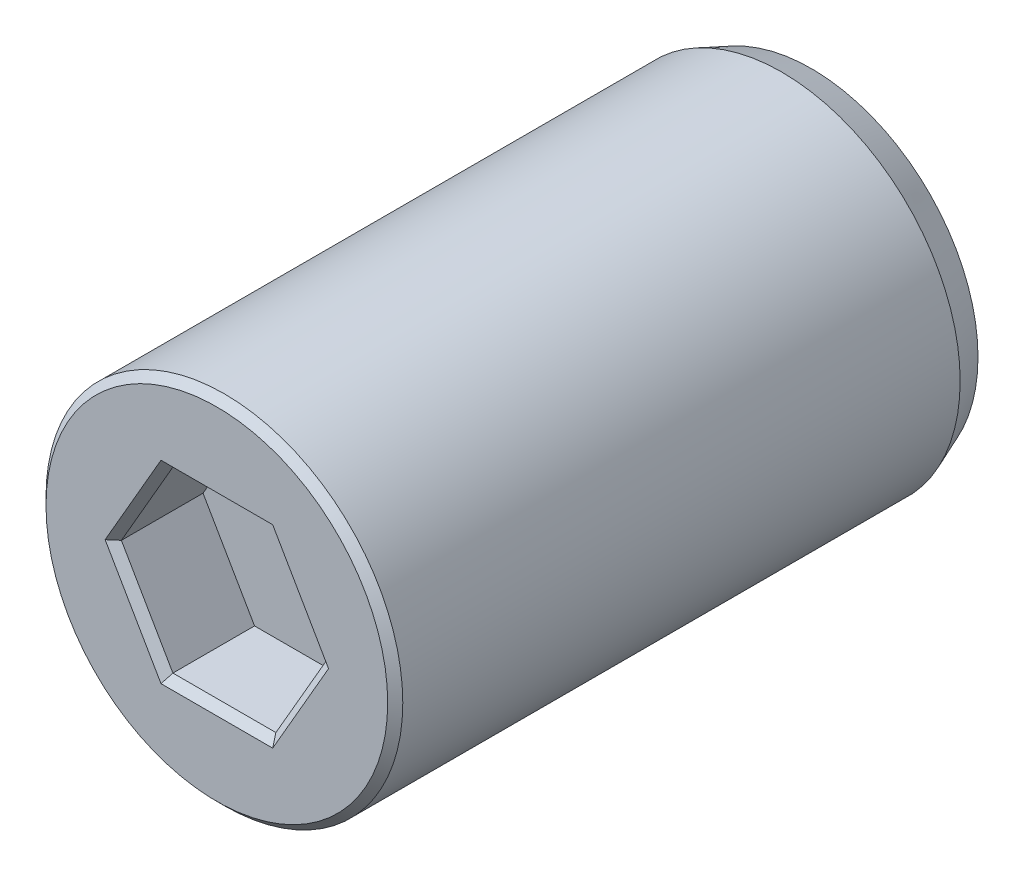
ISO-10303-21;
HEADER;
FILE_DESCRIPTION(('STEP AP214'),'2;1');
FILE_NAME('part.step','',(''),(''),'','','');
FILE_SCHEMA(('AUTOMOTIVE_DESIGN { 1 0 10303 214 1 1 1 1 }'));
ENDSEC;
DATA;
#1=APPLICATION_CONTEXT('core data for automotive mechanical design processes');
#2=APPLICATION_PROTOCOL_DEFINITION('international standard','automotive_design',2000,#1);
#3=PRODUCT_CONTEXT('',#1,'mechanical');
#4=PRODUCT('Part','Part','',(#3));
#5=PRODUCT_RELATED_PRODUCT_CATEGORY('part','',(#4));
#6=PRODUCT_DEFINITION_FORMATION('','',#4);
#7=PRODUCT_DEFINITION_CONTEXT('part definition',#1,'design');
#8=PRODUCT_DEFINITION('design','',#6,#7);
#9=PRODUCT_DEFINITION_SHAPE('','',#8);
#10=(LENGTH_UNIT() NAMED_UNIT(*) SI_UNIT(.MILLI.,.METRE.));
#11=(NAMED_UNIT(*) PLANE_ANGLE_UNIT() SI_UNIT($,.RADIAN.));
#12=(NAMED_UNIT(*) SI_UNIT($,.STERADIAN.) SOLID_ANGLE_UNIT());
#13=UNCERTAINTY_MEASURE_WITH_UNIT(LENGTH_MEASURE(1.E-05),#10,'distance_accuracy_value','');
#14=(GEOMETRIC_REPRESENTATION_CONTEXT(3) GLOBAL_UNCERTAINTY_ASSIGNED_CONTEXT((#13)) GLOBAL_UNIT_ASSIGNED_CONTEXT((#10,
#11,#12)) REPRESENTATION_CONTEXT('',''));
#15=CARTESIAN_POINT('',(0.,0.,0.));
#16=DIRECTION('',(0.,0.,1.));
#17=DIRECTION('',(1.,0.,0.));
#18=AXIS2_PLACEMENT_3D('',#15,#16,#17);
#19=CARTESIAN_POINT('',(0.,0.,-10.));
#20=DIRECTION('',(0.,0.,1.));
#21=DIRECTION('',(1.,0.,0.));
#22=AXIS2_PLACEMENT_3D('',#19,#20,#21);
#23=CYLINDRICAL_SURFACE('',#22,6.);
#24=CARTESIAN_POINT('',(0.,0.,-9.));
#25=DIRECTION('',(0.,0.,1.));
#26=DIRECTION('',(1.,0.,0.));
#27=AXIS2_PLACEMENT_3D('',#24,#25,#26);
#28=CIRCLE('',#27,6.);
#29=CARTESIAN_POINT('',(6.,0.,-9.));
#30=VERTEX_POINT('',#29);
#31=EDGE_CURVE('E38',#30,#30,#28,.T.);
#32=ORIENTED_EDGE('',*,*,#31,.T.);
#33=EDGE_LOOP('',(#32));
#34=FACE_BOUND('',#33,.T.);
#35=CARTESIAN_POINT('',(0.,0.,9.746));
#36=DIRECTION('',(0.,0.,1.));
#37=DIRECTION('',(1.,0.,0.));
#38=AXIS2_PLACEMENT_3D('',#35,#36,#37);
#39=CIRCLE('',#38,6.);
#40=CARTESIAN_POINT('',(6.,0.,9.746));
#41=VERTEX_POINT('',#40);
#42=EDGE_CURVE('E177',#41,#41,#39,.F.);
#43=ORIENTED_EDGE('',*,*,#42,.T.);
#44=EDGE_LOOP('',(#43));
#45=FACE_BOUND('',#44,.T.);
#46=ADVANCED_FACE('F31',(#34,#45),#23,.T.);
#47=CARTESIAN_POINT('',(0.,0.,-10.));
#48=DIRECTION('',(0.,0.,1.));
#49=DIRECTION('',(1.,0.,0.));
#50=AXIS2_PLACEMENT_3D('',#47,#48,#49);
#51=PLANE('',#50);
#52=CARTESIAN_POINT('',(0.,0.,-10.));
#53=DIRECTION('',(0.,0.,1.));
#54=DIRECTION('',(1.,0.,0.));
#55=AXIS2_PLACEMENT_3D('',#52,#53,#54);
#56=CIRCLE('',#55,5.6);
#57=CARTESIAN_POINT('',(5.6,0.,-10.));
#58=VERTEX_POINT('',#57);
#59=EDGE_CURVE('E11',#58,#58,#56,.F.);
#60=ORIENTED_EDGE('',*,*,#59,.T.);
#61=EDGE_LOOP('',(#60));
#62=FACE_BOUND('',#61,.T.);
#63=ADVANCED_FACE('F197',(#62),#51,.F.);
#64=CARTESIAN_POINT('',(0.,0.,10.));
#65=DIRECTION('',(0.,0.,1.));
#66=DIRECTION('',(1.,0.,0.));
#67=AXIS2_PLACEMENT_3D('',#64,#65,#66);
#68=PLANE('',#67);
#69=DIRECTION('',(1.,0.,0.));
#70=VECTOR('',#69,1.);
#71=CARTESIAN_POINT('',(1.73205080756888,3.254,10.));
#72=LINE('',#71,#70);
#73=CARTESIAN_POINT('',(-1.87869777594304,3.254,10.));
#74=VERTEX_POINT('',#73);
#75=CARTESIAN_POINT('',(1.87869777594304,3.254,10.));
#76=VERTEX_POINT('',#75);
#77=EDGE_CURVE('E165',#74,#76,#72,.T.);
#78=ORIENTED_EDGE('',*,*,#77,.T.);
#79=DIRECTION('',(0.5,-0.866025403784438,0.));
#80=VECTOR('',#79,1.);
#81=CARTESIAN_POINT('',(3.68407206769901,0.127000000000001,10.));
#82=LINE('',#81,#80);
#83=CARTESIAN_POINT('',(3.75739555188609,0.,10.));
#84=VERTEX_POINT('',#83);
#85=EDGE_CURVE('E167',#76,#84,#82,.T.);
#86=ORIENTED_EDGE('',*,*,#85,.T.);
#87=DIRECTION('',(-0.5,-0.866025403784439,0.));
#88=VECTOR('',#87,1.);
#89=CARTESIAN_POINT('',(1.95202126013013,-3.127,10.));
#90=LINE('',#89,#88);
#91=CARTESIAN_POINT('',(1.87869777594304,-3.254,10.));
#92=VERTEX_POINT('',#91);
#93=EDGE_CURVE('E157',#84,#92,#90,.T.);
#94=ORIENTED_EDGE('',*,*,#93,.T.);
#95=DIRECTION('',(-1.,0.,0.));
#96=VECTOR('',#95,1.);
#97=CARTESIAN_POINT('',(-1.73205080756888,-3.254,10.));
#98=LINE('',#97,#96);
#99=CARTESIAN_POINT('',(-1.87869777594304,-3.254,10.));
#100=VERTEX_POINT('',#99);
#101=EDGE_CURVE('E159',#92,#100,#98,.T.);
#102=ORIENTED_EDGE('',*,*,#101,.T.);
#103=DIRECTION('',(-0.5,0.866025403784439,0.));
#104=VECTOR('',#103,1.);
#105=CARTESIAN_POINT('',(-3.684072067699,-0.127,10.));
#106=LINE('',#105,#104);
#107=CARTESIAN_POINT('',(-3.75739555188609,0.,10.));
#108=VERTEX_POINT('',#107);
#109=EDGE_CURVE('E161',#100,#108,#106,.T.);
#110=ORIENTED_EDGE('',*,*,#109,.T.);
#111=DIRECTION('',(0.5,0.866025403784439,0.));
#112=VECTOR('',#111,1.);
#113=CARTESIAN_POINT('',(-1.95202126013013,3.127,10.));
#114=LINE('',#113,#112);
#115=EDGE_CURVE('E163',#108,#74,#114,.T.);
#116=ORIENTED_EDGE('',*,*,#115,.T.);
#117=EDGE_LOOP('',(#78,#86,#94,#102,#110,#116));
#118=FACE_BOUND('',#117,.T.);
#119=CARTESIAN_POINT('',(0.,0.,10.));
#120=DIRECTION('',(0.,0.,1.));
#121=DIRECTION('',(1.,0.,0.));
#122=AXIS2_PLACEMENT_3D('',#119,#120,#121);
#123=CIRCLE('',#122,5.746);
#124=CARTESIAN_POINT('',(5.746,0.,10.));
#125=VERTEX_POINT('',#124);
#126=EDGE_CURVE('E154',#125,#125,#123,.T.);
#127=ORIENTED_EDGE('',*,*,#126,.T.);
#128=EDGE_LOOP('',(#127));
#129=FACE_BOUND('',#128,.T.);
#130=ADVANCED_FACE('F201',(#118,#129),#68,.T.);
#131=CARTESIAN_POINT('',(1.73205080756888,-3.,7.));
#132=DIRECTION('',(0.866025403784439,-0.5,0.));
#133=DIRECTION('',(0.5,0.866025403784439,0.));
#134=AXIS2_PLACEMENT_3D('',#131,#132,#133);
#135=PLANE('',#134);
#136=DIRECTION('',(0.,0.,1.));
#137=VECTOR('',#136,1.);
#138=CARTESIAN_POINT('',(1.73205080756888,-3.,7.));
#139=LINE('',#138,#137);
#140=CARTESIAN_POINT('',(1.73205080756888,-3.,7.));
#141=VERTEX_POINT('',#140);
#142=CARTESIAN_POINT('',(1.73205080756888,-3.,9.746));
#143=VERTEX_POINT('',#142);
#144=EDGE_CURVE('E142',#141,#143,#139,.T.);
#145=ORIENTED_EDGE('',*,*,#144,.T.);
#146=DIRECTION('',(0.5,0.866025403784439,0.));
#147=VECTOR('',#146,1.);
#148=CARTESIAN_POINT('',(3.46410161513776,0.,9.746));
#149=LINE('',#148,#147);
#150=CARTESIAN_POINT('',(3.46410161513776,0.,9.746));
#151=VERTEX_POINT('',#150);
#152=EDGE_CURVE('E109',#143,#151,#149,.T.);
#153=ORIENTED_EDGE('',*,*,#152,.T.);
#154=DIRECTION('',(0.,0.,1.));
#155=VECTOR('',#154,1.);
#156=CARTESIAN_POINT('',(3.46410161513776,0.,7.));
#157=LINE('',#156,#155);
#158=CARTESIAN_POINT('',(3.46410161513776,0.,7.));
#159=VERTEX_POINT('',#158);
#160=EDGE_CURVE('E102',#159,#151,#157,.T.);
#161=ORIENTED_EDGE('',*,*,#160,.F.);
#162=DIRECTION('',(0.5,0.866025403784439,0.));
#163=VECTOR('',#162,1.);
#164=CARTESIAN_POINT('',(1.73205080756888,-3.,7.));
#165=LINE('',#164,#163);
#166=EDGE_CURVE('E106',#141,#159,#165,.T.);
#167=ORIENTED_EDGE('',*,*,#166,.F.);
#168=EDGE_LOOP('',(#145,#153,#161,#167));
#169=FACE_BOUND('',#168,.T.);
#170=ADVANCED_FACE('F104',(#169),#135,.F.);
#171=CARTESIAN_POINT('',(-1.73205080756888,-3.,7.));
#172=DIRECTION('',(0.,-1.,0.));
#173=DIRECTION('',(1.,0.,0.));
#174=AXIS2_PLACEMENT_3D('',#171,#172,#173);
#175=PLANE('',#174);
#176=DIRECTION('',(0.,0.,1.));
#177=VECTOR('',#176,1.);
#178=CARTESIAN_POINT('',(-1.73205080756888,-3.,7.));
#179=LINE('',#178,#177);
#180=CARTESIAN_POINT('',(-1.73205080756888,-3.,7.));
#181=VERTEX_POINT('',#180);
#182=CARTESIAN_POINT('',(-1.73205080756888,-3.,9.746));
#183=VERTEX_POINT('',#182);
#184=EDGE_CURVE('E145',#181,#183,#179,.T.);
#185=ORIENTED_EDGE('',*,*,#184,.T.);
#186=DIRECTION('',(1.,0.,0.));
#187=VECTOR('',#186,1.);
#188=CARTESIAN_POINT('',(1.73205080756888,-3.,9.746));
#189=LINE('',#188,#187);
#190=EDGE_CURVE('E45',#183,#143,#189,.T.);
#191=ORIENTED_EDGE('',*,*,#190,.T.);
#192=ORIENTED_EDGE('',*,*,#144,.F.);
#193=DIRECTION('',(1.,0.,0.));
#194=VECTOR('',#193,1.);
#195=CARTESIAN_POINT('',(-1.73205080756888,-3.,7.));
#196=LINE('',#195,#194);
#197=EDGE_CURVE('E114',#181,#141,#196,.T.);
#198=ORIENTED_EDGE('',*,*,#197,.F.);
#199=EDGE_LOOP('',(#185,#191,#192,#198));
#200=FACE_BOUND('',#199,.T.);
#201=ADVANCED_FACE('F211',(#200),#175,.F.);
#202=CARTESIAN_POINT('',(-3.46410161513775,0.,7.));
#203=DIRECTION('',(-0.866025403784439,-0.5,0.));
#204=DIRECTION('',(0.5,-0.866025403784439,0.));
#205=AXIS2_PLACEMENT_3D('',#202,#203,#204);
#206=PLANE('',#205);
#207=DIRECTION('',(0.,0.,1.));
#208=VECTOR('',#207,1.);
#209=CARTESIAN_POINT('',(-3.46410161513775,0.,7.));
#210=LINE('',#209,#208);
#211=CARTESIAN_POINT('',(-3.46410161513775,0.,7.));
#212=VERTEX_POINT('',#211);
#213=CARTESIAN_POINT('',(-3.46410161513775,0.,9.746));
#214=VERTEX_POINT('',#213);
#215=EDGE_CURVE('E147',#212,#214,#210,.T.);
#216=ORIENTED_EDGE('',*,*,#215,.T.);
#217=DIRECTION('',(0.5,-0.866025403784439,0.));
#218=VECTOR('',#217,1.);
#219=CARTESIAN_POINT('',(-1.73205080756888,-3.,9.746));
#220=LINE('',#219,#218);
#221=EDGE_CURVE('E53',#214,#183,#220,.T.);
#222=ORIENTED_EDGE('',*,*,#221,.T.);
#223=ORIENTED_EDGE('',*,*,#184,.F.);
#224=DIRECTION('',(0.5,-0.866025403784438,0.));
#225=VECTOR('',#224,1.);
#226=CARTESIAN_POINT('',(-3.46410161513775,0.,7.));
#227=LINE('',#226,#225);
#228=EDGE_CURVE('E139',#212,#181,#227,.T.);
#229=ORIENTED_EDGE('',*,*,#228,.F.);
#230=EDGE_LOOP('',(#216,#222,#223,#229));
#231=FACE_BOUND('',#230,.T.);
#232=ADVANCED_FACE('F221',(#231),#206,.F.);
#233=CARTESIAN_POINT('',(-1.73205080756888,3.,7.));
#234=DIRECTION('',(-0.866025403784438,0.5,0.));
#235=DIRECTION('',(-0.5,-0.866025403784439,0.));
#236=AXIS2_PLACEMENT_3D('',#233,#234,#235);
#237=PLANE('',#236);
#238=DIRECTION('',(0.,0.,1.));
#239=VECTOR('',#238,1.);
#240=CARTESIAN_POINT('',(-1.73205080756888,3.,7.));
#241=LINE('',#240,#239);
#242=CARTESIAN_POINT('',(-1.73205080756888,3.,7.));
#243=VERTEX_POINT('',#242);
#244=CARTESIAN_POINT('',(-1.73205080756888,3.,9.746));
#245=VERTEX_POINT('',#244);
#246=EDGE_CURVE('E149',#243,#245,#241,.T.);
#247=ORIENTED_EDGE('',*,*,#246,.T.);
#248=DIRECTION('',(-0.5,-0.866025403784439,0.));
#249=VECTOR('',#248,1.);
#250=CARTESIAN_POINT('',(-3.46410161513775,0.,9.746));
#251=LINE('',#250,#249);
#252=EDGE_CURVE('E172',#245,#214,#251,.T.);
#253=ORIENTED_EDGE('',*,*,#252,.T.);
#254=ORIENTED_EDGE('',*,*,#215,.F.);
#255=DIRECTION('',(-0.5,-0.866025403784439,0.));
#256=VECTOR('',#255,1.);
#257=CARTESIAN_POINT('',(-1.73205080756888,3.,7.));
#258=LINE('',#257,#256);
#259=EDGE_CURVE('E136',#243,#212,#258,.T.);
#260=ORIENTED_EDGE('',*,*,#259,.F.);
#261=EDGE_LOOP('',(#247,#253,#254,#260));
#262=FACE_BOUND('',#261,.T.);
#263=ADVANCED_FACE('F217',(#262),#237,.F.);
#264=CARTESIAN_POINT('',(1.73205080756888,3.,7.));
#265=DIRECTION('',(0.,1.,0.));
#266=DIRECTION('',(0.,0.,1.));
#267=AXIS2_PLACEMENT_3D('',#264,#265,#266);
#268=PLANE('',#267);
#269=DIRECTION('',(0.,0.,1.));
#270=VECTOR('',#269,1.);
#271=CARTESIAN_POINT('',(1.73205080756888,3.,7.));
#272=LINE('',#271,#270);
#273=CARTESIAN_POINT('',(1.73205080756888,3.,7.));
#274=VERTEX_POINT('',#273);
#275=CARTESIAN_POINT('',(1.73205080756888,3.,9.746));
#276=VERTEX_POINT('',#275);
#277=EDGE_CURVE('E113',#274,#276,#272,.T.);
#278=ORIENTED_EDGE('',*,*,#277,.T.);
#279=DIRECTION('',(-1.,0.,0.));
#280=VECTOR('',#279,1.);
#281=CARTESIAN_POINT('',(-1.73205080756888,3.,9.746));
#282=LINE('',#281,#280);
#283=EDGE_CURVE('E170',#276,#245,#282,.T.);
#284=ORIENTED_EDGE('',*,*,#283,.T.);
#285=ORIENTED_EDGE('',*,*,#246,.F.);
#286=DIRECTION('',(-1.,0.,0.));
#287=VECTOR('',#286,1.);
#288=CARTESIAN_POINT('',(1.73205080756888,3.,7.));
#289=LINE('',#288,#287);
#290=EDGE_CURVE('E123',#274,#243,#289,.T.);
#291=ORIENTED_EDGE('',*,*,#290,.F.);
#292=EDGE_LOOP('',(#278,#284,#285,#291));
#293=FACE_BOUND('',#292,.T.);
#294=ADVANCED_FACE('F214',(#293),#268,.F.);
#295=CARTESIAN_POINT('',(3.46410161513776,0.,7.));
#296=DIRECTION('',(0.866025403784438,0.5,0.));
#297=DIRECTION('',(-0.5,0.866025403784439,0.));
#298=AXIS2_PLACEMENT_3D('',#295,#296,#297);
#299=PLANE('',#298);
#300=ORIENTED_EDGE('',*,*,#160,.T.);
#301=DIRECTION('',(-0.5,0.866025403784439,0.));
#302=VECTOR('',#301,1.);
#303=CARTESIAN_POINT('',(1.73205080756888,3.,9.746));
#304=LINE('',#303,#302);
#305=EDGE_CURVE('E144',#151,#276,#304,.T.);
#306=ORIENTED_EDGE('',*,*,#305,.T.);
#307=ORIENTED_EDGE('',*,*,#277,.F.);
#308=DIRECTION('',(-0.5,0.866025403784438,0.));
#309=VECTOR('',#308,1.);
#310=CARTESIAN_POINT('',(3.46410161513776,0.,7.));
#311=LINE('',#310,#309);
#312=EDGE_CURVE('E117',#159,#274,#311,.T.);
#313=ORIENTED_EDGE('',*,*,#312,.F.);
#314=EDGE_LOOP('',(#300,#306,#307,#313));
#315=FACE_BOUND('',#314,.T.);
#316=ADVANCED_FACE('F118',(#315),#299,.F.);
#317=CARTESIAN_POINT('',(1.73205080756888,-3.,7.));
#318=DIRECTION('',(0.,0.,-1.));
#319=DIRECTION('',(-1.,0.,0.));
#320=AXIS2_PLACEMENT_3D('',#317,#318,#319);
#321=PLANE('',#320);
#322=ORIENTED_EDGE('',*,*,#166,.T.);
#323=ORIENTED_EDGE('',*,*,#312,.T.);
#324=ORIENTED_EDGE('',*,*,#290,.T.);
#325=ORIENTED_EDGE('',*,*,#259,.T.);
#326=ORIENTED_EDGE('',*,*,#228,.T.);
#327=ORIENTED_EDGE('',*,*,#197,.T.);
#328=EDGE_LOOP('',(#322,#323,#324,#325,#326,#327));
#329=FACE_BOUND('',#328,.T.);
#330=ADVANCED_FACE('F125',(#329),#321,.F.);
#331=CARTESIAN_POINT('',(-3.46410161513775,0.,9.746));
#332=DIRECTION('',(0.61237243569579,0.353553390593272,0.707106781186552));
#333=DIRECTION('',(0.755928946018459,0.,-0.654653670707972));
#334=AXIS2_PLACEMENT_3D('',#331,#332,#333);
#335=PLANE('',#334);
#336=DIRECTION('',(-0.755928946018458,0.,0.654653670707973));
#337=VECTOR('',#336,1.);
#338=CARTESIAN_POINT('',(-2.47435829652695,0.,8.88885714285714));
#339=LINE('',#338,#337);
#340=EDGE_CURVE('E131',#108,#214,#339,.F.);
#341=ORIENTED_EDGE('',*,*,#340,.F.);
#342=ORIENTED_EDGE('',*,*,#109,.F.);
#343=DIRECTION('',(-0.37796447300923,-0.65465367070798,0.654653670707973));
#344=VECTOR('',#343,1.);
#345=CARTESIAN_POINT('',(-1.23717914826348,-2.14285714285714,8.88885714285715));
#346=LINE('',#345,#344);
#347=EDGE_CURVE('E128',#183,#100,#346,.T.);
#348=ORIENTED_EDGE('',*,*,#347,.F.);
#349=ORIENTED_EDGE('',*,*,#221,.F.);
#350=EDGE_LOOP('',(#341,#342,#348,#349));
#351=FACE_BOUND('',#350,.T.);
#352=ADVANCED_FACE('F229',(#351),#335,.T.);
#353=CARTESIAN_POINT('',(-1.73205080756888,-3.,9.746));
#354=DIRECTION('',(0.,0.707106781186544,0.707106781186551));
#355=DIRECTION('',(0.,-0.707106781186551,0.707106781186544));
#356=AXIS2_PLACEMENT_3D('',#353,#354,#355);
#357=PLANE('',#356);
#358=ORIENTED_EDGE('',*,*,#347,.T.);
#359=ORIENTED_EDGE('',*,*,#101,.F.);
#360=DIRECTION('',(0.377964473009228,-0.65465367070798,0.654653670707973));
#361=VECTOR('',#360,1.);
#362=CARTESIAN_POINT('',(1.23717914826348,-2.14285714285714,8.88885714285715));
#363=LINE('',#362,#361);
#364=EDGE_CURVE('E263',#143,#92,#363,.T.);
#365=ORIENTED_EDGE('',*,*,#364,.F.);
#366=ORIENTED_EDGE('',*,*,#190,.F.);
#367=EDGE_LOOP('',(#358,#359,#365,#366));
#368=FACE_BOUND('',#367,.T.);
#369=ADVANCED_FACE('F232',(#368),#357,.T.);
#370=CARTESIAN_POINT('',(-1.73205080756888,3.,9.746));
#371=DIRECTION('',(0.612372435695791,-0.353553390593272,0.707106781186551));
#372=DIRECTION('',(0.755928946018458,0.,-0.654653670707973));
#373=AXIS2_PLACEMENT_3D('',#370,#371,#372);
#374=PLANE('',#373);
#375=ORIENTED_EDGE('',*,*,#340,.T.);
#376=ORIENTED_EDGE('',*,*,#252,.F.);
#377=DIRECTION('',(-0.377964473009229,0.65465367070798,0.654653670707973));
#378=VECTOR('',#377,1.);
#379=CARTESIAN_POINT('',(-1.23717914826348,2.14285714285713,8.88885714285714));
#380=LINE('',#379,#378);
#381=EDGE_CURVE('E258',#74,#245,#380,.F.);
#382=ORIENTED_EDGE('',*,*,#381,.F.);
#383=ORIENTED_EDGE('',*,*,#115,.F.);
#384=EDGE_LOOP('',(#375,#376,#382,#383));
#385=FACE_BOUND('',#384,.T.);
#386=ADVANCED_FACE('F236',(#385),#374,.T.);
#387=CARTESIAN_POINT('',(1.73205080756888,-3.,9.746));
#388=DIRECTION('',(-0.612372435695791,0.353553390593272,0.707106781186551));
#389=DIRECTION('',(0.755928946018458,0.,0.654653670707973));
#390=AXIS2_PLACEMENT_3D('',#387,#388,#389);
#391=PLANE('',#390);
#392=ORIENTED_EDGE('',*,*,#364,.T.);
#393=ORIENTED_EDGE('',*,*,#93,.F.);
#394=DIRECTION('',(-0.755928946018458,0.,-0.654653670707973));
#395=VECTOR('',#394,1.);
#396=CARTESIAN_POINT('',(3.46410161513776,0.,9.746));
#397=LINE('',#396,#395);
#398=EDGE_CURVE('E255',#151,#84,#397,.F.);
#399=ORIENTED_EDGE('',*,*,#398,.F.);
#400=ORIENTED_EDGE('',*,*,#152,.F.);
#401=EDGE_LOOP('',(#392,#393,#399,#400));
#402=FACE_BOUND('',#401,.T.);
#403=ADVANCED_FACE('F240',(#402),#391,.T.);
#404=CARTESIAN_POINT('',(1.73205080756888,3.,9.746));
#405=DIRECTION('',(0.,-0.707106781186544,0.707106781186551));
#406=DIRECTION('',(0.,-0.707106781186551,-0.707106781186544));
#407=AXIS2_PLACEMENT_3D('',#404,#405,#406);
#408=PLANE('',#407);
#409=ORIENTED_EDGE('',*,*,#381,.T.);
#410=ORIENTED_EDGE('',*,*,#283,.F.);
#411=DIRECTION('',(0.37796447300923,0.65465367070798,0.654653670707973));
#412=VECTOR('',#411,1.);
#413=CARTESIAN_POINT('',(1.23717914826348,2.14285714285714,8.88885714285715));
#414=LINE('',#413,#412);
#415=EDGE_CURVE('E259',#76,#276,#414,.F.);
#416=ORIENTED_EDGE('',*,*,#415,.F.);
#417=ORIENTED_EDGE('',*,*,#77,.F.);
#418=EDGE_LOOP('',(#409,#410,#416,#417));
#419=FACE_BOUND('',#418,.T.);
#420=ADVANCED_FACE('F244',(#419),#408,.T.);
#421=CARTESIAN_POINT('',(3.46410161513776,0.,9.746));
#422=DIRECTION('',(-0.612372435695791,-0.353553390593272,0.707106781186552));
#423=DIRECTION('',(0.755928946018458,0.,0.654653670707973));
#424=AXIS2_PLACEMENT_3D('',#421,#422,#423);
#425=PLANE('',#424);
#426=ORIENTED_EDGE('',*,*,#398,.T.);
#427=ORIENTED_EDGE('',*,*,#85,.F.);
#428=ORIENTED_EDGE('',*,*,#415,.T.);
#429=ORIENTED_EDGE('',*,*,#305,.F.);
#430=EDGE_LOOP('',(#426,#427,#428,#429));
#431=FACE_BOUND('',#430,.T.);
#432=ADVANCED_FACE('F192',(#431),#425,.T.);
#433=CARTESIAN_POINT('',(0.,0.,10.));
#434=DIRECTION('',(0.,0.,-1.));
#435=DIRECTION('',(-1.,0.,0.));
#436=AXIS2_PLACEMENT_3D('',#433,#434,#435);
#437=CONICAL_SURFACE('',#436,5.746,0.785398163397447);
#438=ORIENTED_EDGE('',*,*,#42,.F.);
#439=EDGE_LOOP('',(#438));
#440=FACE_BOUND('',#439,.T.);
#441=ORIENTED_EDGE('',*,*,#126,.F.);
#442=EDGE_LOOP('',(#441));
#443=FACE_BOUND('',#442,.T.);
#444=ADVANCED_FACE('F186',(#440,#443),#437,.T.);
#445=CARTESIAN_POINT('',(0.,0.,-9.));
#446=DIRECTION('',(0.,0.,1.));
#447=DIRECTION('',(1.,0.,0.));
#448=AXIS2_PLACEMENT_3D('',#445,#446,#447);
#449=CONICAL_SURFACE('',#448,6.,0.380506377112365);
#450=ORIENTED_EDGE('',*,*,#59,.F.);
#451=EDGE_LOOP('',(#450));
#452=FACE_BOUND('',#451,.T.);
#453=ORIENTED_EDGE('',*,*,#31,.F.);
#454=EDGE_LOOP('',(#453));
#455=FACE_BOUND('',#454,.T.);
#456=ADVANCED_FACE('F184',(#452,#455),#449,.T.);
#457=CLOSED_SHELL('',(#46,#63,#130,#170,#201,#232,#263,#294,#316,#330,#352,#369,#386,#403,#420,
#432,#444,#456));
#458=MANIFOLD_SOLID_BREP('B2',#457);
#459=ADVANCED_BREP_SHAPE_REPRESENTATION('',(#18,#458),#14);
#460=SHAPE_DEFINITION_REPRESENTATION(#9,#459);
ENDSEC;
END-ISO-10303-21;
